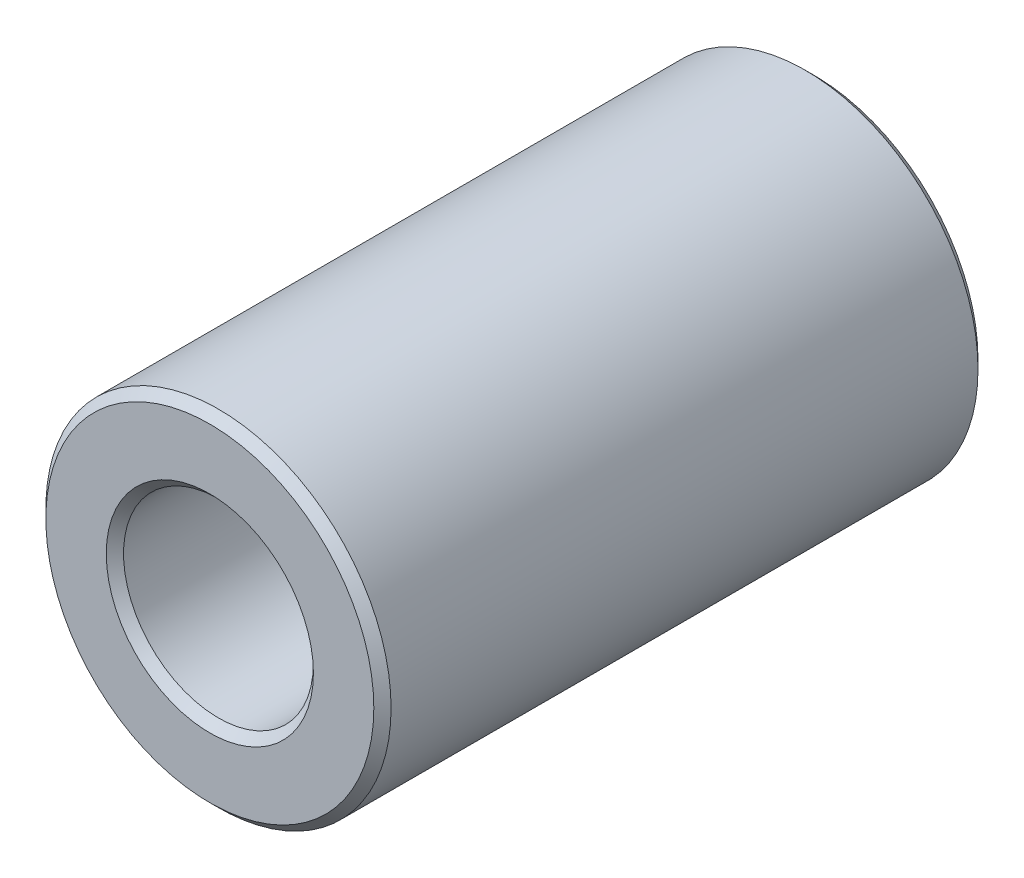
ISO-10303-21;
HEADER;
FILE_DESCRIPTION(('STEP AP214'),'2;1');
FILE_NAME('part.step','',(''),(''),'','','');
FILE_SCHEMA(('AUTOMOTIVE_DESIGN { 1 0 10303 214 1 1 1 1 }'));
ENDSEC;
DATA;
#1=APPLICATION_CONTEXT('core data for automotive mechanical design processes');
#2=APPLICATION_PROTOCOL_DEFINITION('international standard','automotive_design',2000,#1);
#3=PRODUCT_CONTEXT('',#1,'mechanical');
#4=PRODUCT('Part','Part','',(#3));
#5=PRODUCT_RELATED_PRODUCT_CATEGORY('part','',(#4));
#6=PRODUCT_DEFINITION_FORMATION('','',#4);
#7=PRODUCT_DEFINITION_CONTEXT('part definition',#1,'design');
#8=PRODUCT_DEFINITION('design','',#6,#7);
#9=PRODUCT_DEFINITION_SHAPE('','',#8);
#10=(LENGTH_UNIT() NAMED_UNIT(*) SI_UNIT(.MILLI.,.METRE.));
#11=(NAMED_UNIT(*) PLANE_ANGLE_UNIT() SI_UNIT($,.RADIAN.));
#12=(NAMED_UNIT(*) SI_UNIT($,.STERADIAN.) SOLID_ANGLE_UNIT());
#13=UNCERTAINTY_MEASURE_WITH_UNIT(LENGTH_MEASURE(1.E-05),#10,'distance_accuracy_value','');
#14=(GEOMETRIC_REPRESENTATION_CONTEXT(3) GLOBAL_UNCERTAINTY_ASSIGNED_CONTEXT((#13)) GLOBAL_UNIT_ASSIGNED_CONTEXT((#10,
#11,#12)) REPRESENTATION_CONTEXT('',''));
#15=CARTESIAN_POINT('',(0.,0.,0.));
#16=DIRECTION('',(0.,0.,1.));
#17=DIRECTION('',(1.,0.,0.));
#18=AXIS2_PLACEMENT_3D('',#15,#16,#17);
#19=CARTESIAN_POINT('',(0.,0.,3.5));
#20=DIRECTION('',(0.,0.,1.));
#21=DIRECTION('',(1.,0.,0.));
#22=AXIS2_PLACEMENT_3D('',#19,#20,#21);
#23=PLANE('',#22);
#24=CARTESIAN_POINT('',(0.,0.,3.5));
#25=DIRECTION('',(0.,0.,1.));
#26=DIRECTION('',(1.,0.,0.));
#27=AXIS2_PLACEMENT_3D('',#24,#25,#26);
#28=CIRCLE('',#27,1.2);
#29=CARTESIAN_POINT('',(1.2,0.,3.5));
#30=VERTEX_POINT('',#29);
#31=EDGE_CURVE('E10',#30,#30,#28,.F.);
#32=ORIENTED_EDGE('',*,*,#31,.T.);
#33=EDGE_LOOP('',(#32));
#34=FACE_BOUND('',#33,.T.);
#35=CARTESIAN_POINT('',(0.,0.,3.5));
#36=DIRECTION('',(0.,0.,1.));
#37=DIRECTION('',(1.,0.,0.));
#38=AXIS2_PLACEMENT_3D('',#35,#36,#37);
#39=CIRCLE('',#38,1.9);
#40=CARTESIAN_POINT('',(1.9,0.,3.5));
#41=VERTEX_POINT('',#40);
#42=EDGE_CURVE('E45',#41,#41,#39,.T.);
#43=ORIENTED_EDGE('',*,*,#42,.T.);
#44=EDGE_LOOP('',(#43));
#45=FACE_BOUND('',#44,.T.);
#46=ADVANCED_FACE('F37',(#34,#45),#23,.T.);
#47=CARTESIAN_POINT('',(0.,0.,-3.5));
#48=DIRECTION('',(0.,0.,1.));
#49=DIRECTION('',(1.,0.,0.));
#50=AXIS2_PLACEMENT_3D('',#47,#48,#49);
#51=PLANE('',#50);
#52=CARTESIAN_POINT('',(0.,0.,-3.5));
#53=DIRECTION('',(0.,0.,1.));
#54=DIRECTION('',(1.,0.,0.));
#55=AXIS2_PLACEMENT_3D('',#52,#53,#54);
#56=CIRCLE('',#55,1.9);
#57=CARTESIAN_POINT('',(1.9,0.,-3.5));
#58=VERTEX_POINT('',#57);
#59=EDGE_CURVE('E63',#58,#58,#56,.F.);
#60=ORIENTED_EDGE('',*,*,#59,.T.);
#61=EDGE_LOOP('',(#60));
#62=FACE_BOUND('',#61,.T.);
#63=CARTESIAN_POINT('',(0.,0.,-3.5));
#64=DIRECTION('',(0.,0.,1.));
#65=DIRECTION('',(1.,0.,0.));
#66=AXIS2_PLACEMENT_3D('',#63,#64,#65);
#67=CIRCLE('',#66,1.2);
#68=CARTESIAN_POINT('',(1.2,0.,-3.5));
#69=VERTEX_POINT('',#68);
#70=EDGE_CURVE('E67',#69,#69,#67,.T.);
#71=ORIENTED_EDGE('',*,*,#70,.T.);
#72=EDGE_LOOP('',(#71));
#73=FACE_BOUND('',#72,.T.);
#74=ADVANCED_FACE('F89',(#62,#73),#51,.F.);
#75=CARTESIAN_POINT('',(0.,0.,3.5));
#76=DIRECTION('',(0.,0.,-1.));
#77=DIRECTION('',(-1.,0.,0.));
#78=AXIS2_PLACEMENT_3D('',#75,#76,#77);
#79=CYLINDRICAL_SURFACE('',#78,2.);
#80=CARTESIAN_POINT('',(0.,0.,-3.4));
#81=DIRECTION('',(0.,0.,1.));
#82=DIRECTION('',(1.,0.,0.));
#83=AXIS2_PLACEMENT_3D('',#80,#81,#82);
#84=CIRCLE('',#83,2.);
#85=CARTESIAN_POINT('',(2.,0.,-3.4));
#86=VERTEX_POINT('',#85);
#87=EDGE_CURVE('E70',#86,#86,#84,.T.);
#88=ORIENTED_EDGE('',*,*,#87,.T.);
#89=EDGE_LOOP('',(#88));
#90=FACE_BOUND('',#89,.T.);
#91=CARTESIAN_POINT('',(0.,0.,3.4));
#92=DIRECTION('',(0.,0.,1.));
#93=DIRECTION('',(1.,0.,0.));
#94=AXIS2_PLACEMENT_3D('',#91,#92,#93);
#95=CIRCLE('',#94,2.);
#96=CARTESIAN_POINT('',(2.,0.,3.4));
#97=VERTEX_POINT('',#96);
#98=EDGE_CURVE('E74',#97,#97,#95,.F.);
#99=ORIENTED_EDGE('',*,*,#98,.T.);
#100=EDGE_LOOP('',(#99));
#101=FACE_BOUND('',#100,.T.);
#102=ADVANCED_FACE('F78',(#90,#101),#79,.T.);
#103=CARTESIAN_POINT('',(0.,0.,3.5));
#104=DIRECTION('',(0.,0.,-1.));
#105=DIRECTION('',(-1.,0.,0.));
#106=AXIS2_PLACEMENT_3D('',#103,#104,#105);
#107=CYLINDRICAL_SURFACE('',#106,1.1);
#108=CARTESIAN_POINT('',(0.,0.,-3.4));
#109=DIRECTION('',(0.,0.,1.));
#110=DIRECTION('',(1.,0.,0.));
#111=AXIS2_PLACEMENT_3D('',#108,#109,#110);
#112=CIRCLE('',#111,1.1);
#113=CARTESIAN_POINT('',(1.1,0.,-3.4));
#114=VERTEX_POINT('',#113);
#115=EDGE_CURVE('E51',#114,#114,#112,.F.);
#116=ORIENTED_EDGE('',*,*,#115,.T.);
#117=EDGE_LOOP('',(#116));
#118=FACE_BOUND('',#117,.T.);
#119=CARTESIAN_POINT('',(0.,0.,3.4));
#120=DIRECTION('',(0.,0.,1.));
#121=DIRECTION('',(1.,0.,0.));
#122=AXIS2_PLACEMENT_3D('',#119,#120,#121);
#123=CIRCLE('',#122,1.1);
#124=CARTESIAN_POINT('',(1.1,0.,3.4));
#125=VERTEX_POINT('',#124);
#126=EDGE_CURVE('E57',#125,#125,#123,.T.);
#127=ORIENTED_EDGE('',*,*,#126,.T.);
#128=EDGE_LOOP('',(#127));
#129=FACE_BOUND('',#128,.T.);
#130=ADVANCED_FACE('F97',(#118,#129),#107,.F.);
#131=CARTESIAN_POINT('',(0.,0.,-3.4));
#132=DIRECTION('',(0.,0.,1.));
#133=DIRECTION('',(1.,0.,0.));
#134=AXIS2_PLACEMENT_3D('',#131,#132,#133);
#135=CONICAL_SURFACE('',#134,2.,0.785398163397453);
#136=ORIENTED_EDGE('',*,*,#59,.F.);
#137=EDGE_LOOP('',(#136));
#138=FACE_BOUND('',#137,.T.);
#139=ORIENTED_EDGE('',*,*,#87,.F.);
#140=EDGE_LOOP('',(#139));
#141=FACE_BOUND('',#140,.T.);
#142=ADVANCED_FACE('F102',(#138,#141),#135,.T.);
#143=CARTESIAN_POINT('',(0.,0.,-3.5));
#144=DIRECTION('',(0.,0.,-1.));
#145=DIRECTION('',(-1.,0.,0.));
#146=AXIS2_PLACEMENT_3D('',#143,#144,#145);
#147=CONICAL_SURFACE('',#146,1.2,0.785398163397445);
#148=ORIENTED_EDGE('',*,*,#115,.F.);
#149=EDGE_LOOP('',(#148));
#150=FACE_BOUND('',#149,.T.);
#151=ORIENTED_EDGE('',*,*,#70,.F.);
#152=EDGE_LOOP('',(#151));
#153=FACE_BOUND('',#152,.T.);
#154=ADVANCED_FACE('F86',(#150,#153),#147,.F.);
#155=CARTESIAN_POINT('',(0.,0.,3.4));
#156=DIRECTION('',(0.,0.,1.));
#157=DIRECTION('',(1.,0.,0.));
#158=AXIS2_PLACEMENT_3D('',#155,#156,#157);
#159=CONICAL_SURFACE('',#158,1.1,0.785398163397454);
#160=ORIENTED_EDGE('',*,*,#31,.F.);
#161=EDGE_LOOP('',(#160));
#162=FACE_BOUND('',#161,.T.);
#163=ORIENTED_EDGE('',*,*,#126,.F.);
#164=EDGE_LOOP('',(#163));
#165=FACE_BOUND('',#164,.T.);
#166=ADVANCED_FACE('F82',(#162,#165),#159,.F.);
#167=CARTESIAN_POINT('',(0.,0.,3.5));
#168=DIRECTION('',(0.,0.,-1.));
#169=DIRECTION('',(-1.,0.,0.));
#170=AXIS2_PLACEMENT_3D('',#167,#168,#169);
#171=CONICAL_SURFACE('',#170,1.9,0.78539816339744);
#172=ORIENTED_EDGE('',*,*,#98,.F.);
#173=EDGE_LOOP('',(#172));
#174=FACE_BOUND('',#173,.T.);
#175=ORIENTED_EDGE('',*,*,#42,.F.);
#176=EDGE_LOOP('',(#175));
#177=FACE_BOUND('',#176,.T.);
#178=ADVANCED_FACE('F39',(#174,#177),#171,.T.);
#179=CLOSED_SHELL('',(#46,#74,#102,#130,#142,#154,#166,#178));
#180=MANIFOLD_SOLID_BREP('B2',#179);
#181=ADVANCED_BREP_SHAPE_REPRESENTATION('',(#18,#180),#14);
#182=SHAPE_DEFINITION_REPRESENTATION(#9,#181);
ENDSEC;
END-ISO-10303-21;
